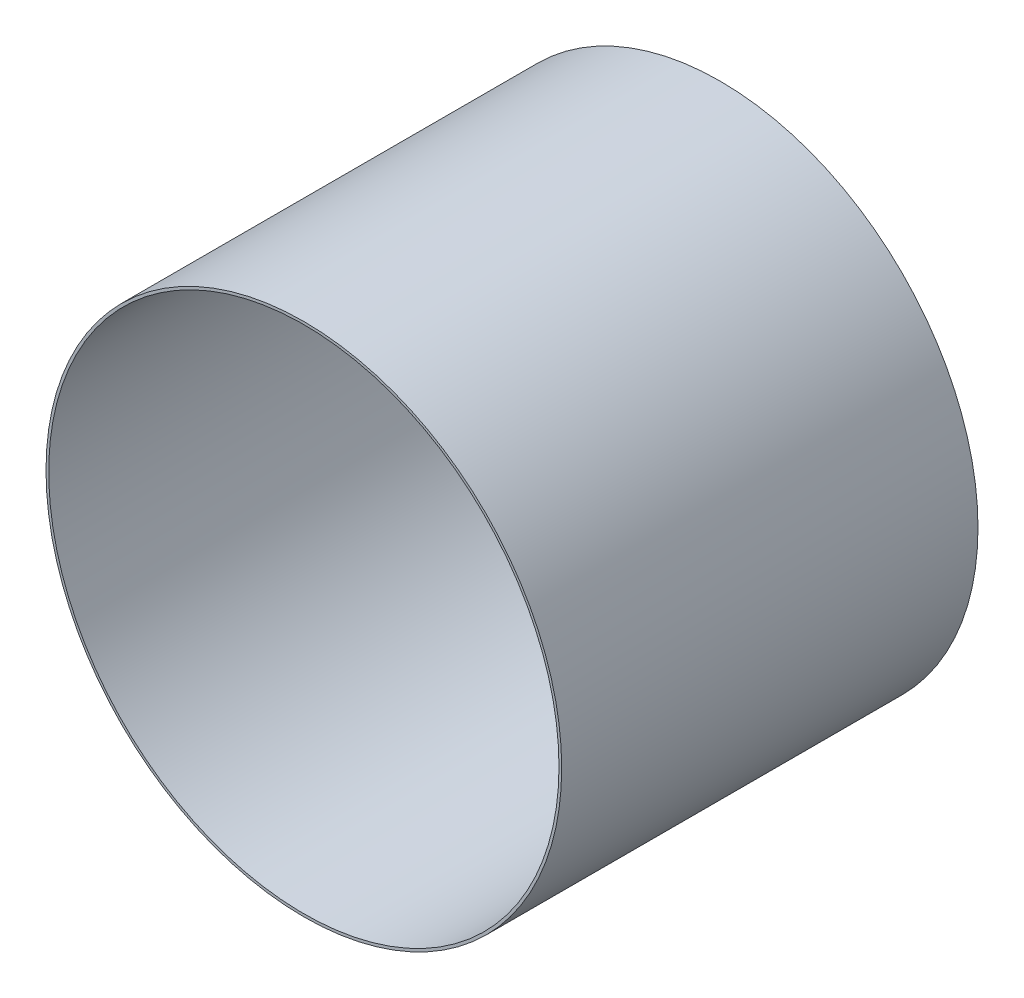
from build123d import *

# Parameters (mm, degrees)
SKETCH1_R           = 19.2
SKETCH1_R_2         = 19
BOSS_EXTRUDE1_DEPTH = 31


with BuildPart() as part:
    # Sketch1 → Boss-Extrude1 (new body)
    with BuildSketch(Plane.XY):
        Circle(SKETCH1_R)
        Circle(SKETCH1_R_2, mode=Mode.SUBTRACT)
    extrude(amount=-BOSS_EXTRUDE1_DEPTH)


solid = part.part
